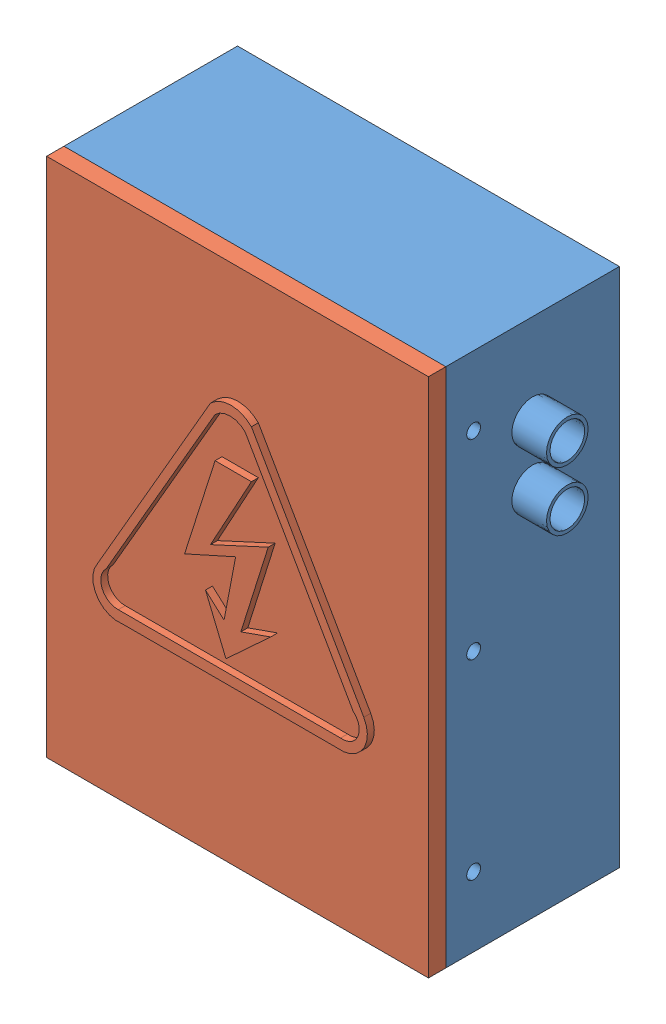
SolidWorks assembly Ensamblaje3.SLDASM, configuration Predeterminado (file format 11000). Lengths in mm.
Overall size (129 150 57).
4 component instances, 4 part files, 4 mates.
Components (placement in the parent):
- base de circuito-1: base de circuito.SLDPRT [Predeterminado] at (-7.6193 6.0954 125) size (120 150 50)
- tapa de circuito-1: tapa de circuito.SLDPRT [Predeterminado] at (-7.6193 6.0954 160) size (110 150 22)
- Lampara Indicadora-1: Lampara Indicadora.SLDPRT [Predeterminado] at (-65.6193 38.0954 150) x (0 -1 0) z (-1 0 0) size (16 16 29)
- Lampara Indicadora 2-1: Lampara Indicadora 2.SLDPRT [Predeterminado] at (-65.6193 55.0954 150) x (0 0 1) z (-1 0 0) size (16 16 29)
Mates (geometry in assembly coordinates):
- Coincidente1: coincident: line of assembly; line of assembly; line of base de circuito-1 through (-62.6193 81.0954 175) axis (0 -1 0); line of tapa de circuito-1 through (-62.6193 81.0954 175) axis (0 -1 0)
- Coincidente2: coincident: line of assembly; plane of assembly; line of base de circuito-1 through (47.3807 81.0954 175) axis (-1 0 0); plane of tapa de circuito-1 through (-62.6193 81.0954 180) normal (0 1 0)
- Coincidente4: coincident: circle of assembly; circle of assembly; circle of base de circuito-1; circle of Lampara Indicadora-1
- Coincidente5: coincident: circle of assembly; circle of assembly; circle of base de circuito-1; circle of Lampara Indicadora 2-1
